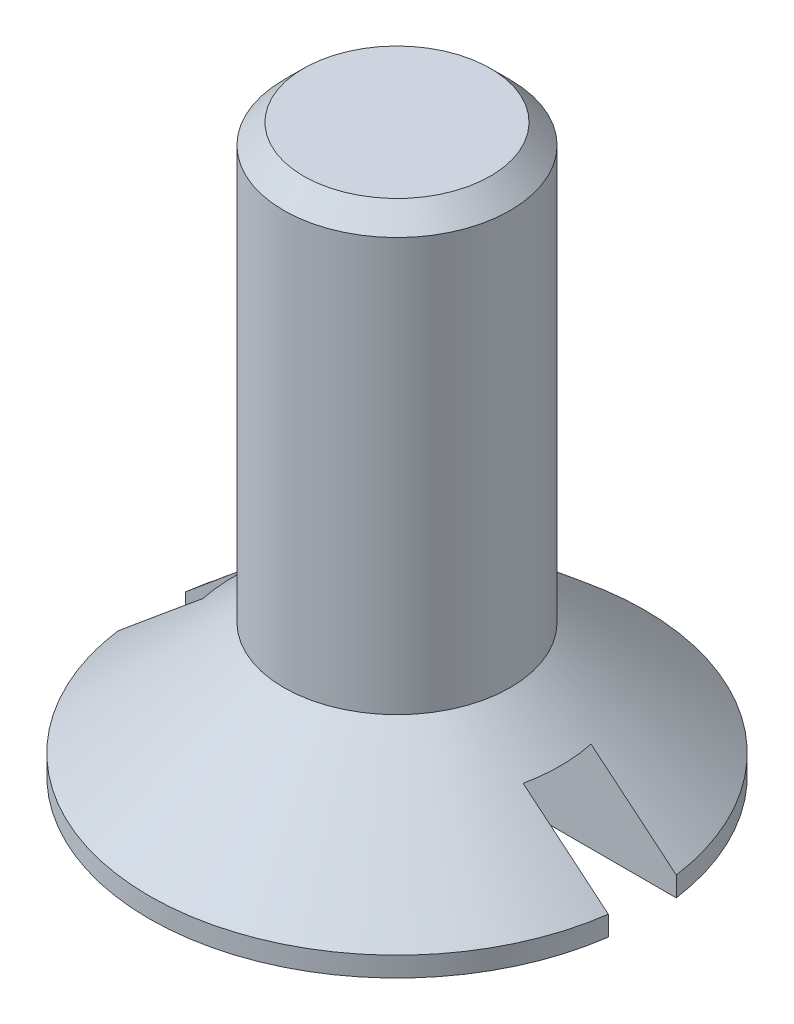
ISO-10303-21;
HEADER;
FILE_DESCRIPTION(('STEP AP214'),'2;1');
FILE_NAME('part.step','',(''),(''),'','','');
FILE_SCHEMA(('AUTOMOTIVE_DESIGN { 1 0 10303 214 1 1 1 1 }'));
ENDSEC;
DATA;
#1=APPLICATION_CONTEXT('core data for automotive mechanical design processes');
#2=APPLICATION_PROTOCOL_DEFINITION('international standard','automotive_design',2000,#1);
#3=PRODUCT_CONTEXT('',#1,'mechanical');
#4=PRODUCT('Part','Part','',(#3));
#5=PRODUCT_RELATED_PRODUCT_CATEGORY('part','',(#4));
#6=PRODUCT_DEFINITION_FORMATION('','',#4);
#7=PRODUCT_DEFINITION_CONTEXT('part definition',#1,'design');
#8=PRODUCT_DEFINITION('design','',#6,#7);
#9=PRODUCT_DEFINITION_SHAPE('','',#8);
#10=(LENGTH_UNIT() NAMED_UNIT(*) SI_UNIT(.MILLI.,.METRE.));
#11=(NAMED_UNIT(*) PLANE_ANGLE_UNIT() SI_UNIT($,.RADIAN.));
#12=(NAMED_UNIT(*) SI_UNIT($,.STERADIAN.) SOLID_ANGLE_UNIT());
#13=UNCERTAINTY_MEASURE_WITH_UNIT(LENGTH_MEASURE(1.E-05),#10,'distance_accuracy_value','');
#14=(GEOMETRIC_REPRESENTATION_CONTEXT(3) GLOBAL_UNCERTAINTY_ASSIGNED_CONTEXT((#13)) GLOBAL_UNIT_ASSIGNED_CONTEXT((#10,
#11,#12)) REPRESENTATION_CONTEXT('',''));
#15=CARTESIAN_POINT('',(0.,0.,0.));
#16=DIRECTION('',(0.,0.,1.));
#17=DIRECTION('',(1.,0.,0.));
#18=AXIS2_PLACEMENT_3D('',#15,#16,#17);
#19=CARTESIAN_POINT('',(0.,10.0000000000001,0.));
#20=DIRECTION('',(0.,-1.,0.));
#21=DIRECTION('',(0.,0.,-1.));
#22=AXIS2_PLACEMENT_3D('',#19,#20,#21);
#23=CYLINDRICAL_SURFACE('',#22,2.);
#24=CARTESIAN_POINT('',(0.,2.35000000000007,0.));
#25=DIRECTION('',(0.,1.,0.));
#26=DIRECTION('',(0.,0.,1.));
#27=AXIS2_PLACEMENT_3D('',#24,#25,#26);
#28=CIRCLE('',#27,2.);
#29=CARTESIAN_POINT('',(0.,2.35000000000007,2.));
#30=VERTEX_POINT('',#29);
#31=EDGE_CURVE('E157',#30,#30,#28,.T.);
#32=ORIENTED_EDGE('',*,*,#31,.T.);
#33=EDGE_LOOP('',(#32));
#34=FACE_BOUND('',#33,.T.);
#35=CARTESIAN_POINT('',(0.,9.65000000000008,0.));
#36=DIRECTION('',(0.,-1.,0.));
#37=DIRECTION('',(0.,0.,-1.));
#38=AXIS2_PLACEMENT_3D('',#35,#36,#37);
#39=CIRCLE('',#38,2.);
#40=CARTESIAN_POINT('',(0.,9.65000000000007,-2.00000000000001));
#41=VERTEX_POINT('',#40);
#42=EDGE_CURVE('E115',#41,#41,#39,.F.);
#43=ORIENTED_EDGE('',*,*,#42,.F.);
#44=EDGE_LOOP('',(#43));
#45=FACE_BOUND('',#44,.T.);
#46=ADVANCED_FACE('F40',(#34,#45),#23,.T.);
#47=CARTESIAN_POINT('',(0.,0.35,0.));
#48=DIRECTION('',(0.,-1.,0.));
#49=DIRECTION('',(0.,0.,-1.));
#50=AXIS2_PLACEMENT_3D('',#47,#48,#49);
#51=CYLINDRICAL_SURFACE('',#50,4.375);
#52=CARTESIAN_POINT('',(0.,0.35,0.));
#53=DIRECTION('',(0.,1.,0.));
#54=DIRECTION('',(0.,0.,1.));
#55=AXIS2_PLACEMENT_3D('',#52,#53,#54);
#56=CIRCLE('',#55,4.375);
#57=CARTESIAN_POINT('',(4.33366184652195,0.35,-0.6));
#58=VERTEX_POINT('',#57);
#59=CARTESIAN_POINT('',(-4.33366184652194,0.349999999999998,-0.6));
#60=VERTEX_POINT('',#59);
#61=EDGE_CURVE('E121',#58,#60,#56,.T.);
#62=ORIENTED_EDGE('',*,*,#61,.F.);
#63=DIRECTION('',(0.,-1.,0.));
#64=VECTOR('',#63,1.);
#65=CARTESIAN_POINT('',(4.33366184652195,0.35,-0.6));
#66=LINE('',#65,#64);
#67=CARTESIAN_POINT('',(4.33366184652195,0.,-0.6));
#68=VERTEX_POINT('',#67);
#69=EDGE_CURVE('E100',#58,#68,#66,.T.);
#70=ORIENTED_EDGE('',*,*,#69,.T.);
#71=CARTESIAN_POINT('',(0.,0.,0.));
#72=DIRECTION('',(0.,1.,0.));
#73=DIRECTION('',(0.,0.,1.));
#74=AXIS2_PLACEMENT_3D('',#71,#72,#73);
#75=CIRCLE('',#74,4.375);
#76=CARTESIAN_POINT('',(-4.33366184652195,0.,-0.6));
#77=VERTEX_POINT('',#76);
#78=EDGE_CURVE('E180',#68,#77,#75,.T.);
#79=ORIENTED_EDGE('',*,*,#78,.T.);
#80=DIRECTION('',(0.,-1.,0.));
#81=VECTOR('',#80,1.);
#82=CARTESIAN_POINT('',(-4.33366184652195,0.35,-0.6));
#83=LINE('',#82,#81);
#84=EDGE_CURVE('E166',#77,#60,#83,.F.);
#85=ORIENTED_EDGE('',*,*,#84,.T.);
#86=EDGE_LOOP('',(#62,#70,#79,#85));
#87=FACE_BOUND('',#86,.T.);
#88=ADVANCED_FACE('F147',(#87),#51,.T.);
#89=CARTESIAN_POINT('',(0.,0.,0.));
#90=DIRECTION('',(0.,1.,0.));
#91=DIRECTION('',(0.,0.,1.));
#92=AXIS2_PLACEMENT_3D('',#89,#90,#91);
#93=PLANE('',#92);
#94=CARTESIAN_POINT('',(-4.33366184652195,0.,0.6));
#95=VERTEX_POINT('',#94);
#96=CARTESIAN_POINT('',(4.33366184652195,0.,0.6));
#97=VERTEX_POINT('',#96);
#98=EDGE_CURVE('E131',#95,#97,#75,.T.);
#99=ORIENTED_EDGE('',*,*,#98,.F.);
#100=DIRECTION('',(1.,0.,0.));
#101=VECTOR('',#100,1.);
#102=CARTESIAN_POINT('',(0.,0.,0.6));
#103=LINE('',#102,#101);
#104=EDGE_CURVE('E176',#95,#97,#103,.T.);
#105=ORIENTED_EDGE('',*,*,#104,.T.);
#106=EDGE_LOOP('',(#99,#105));
#107=FACE_BOUND('',#106,.T.);
#108=ADVANCED_FACE('F152',(#107),#93,.F.);
#109=CARTESIAN_POINT('',(-4.33366184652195,0.35,0.6));
#110=VERTEX_POINT('',#109);
#111=CARTESIAN_POINT('',(4.33366184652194,0.349999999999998,0.6));
#112=VERTEX_POINT('',#111);
#113=EDGE_CURVE('E123',#110,#112,#56,.T.);
#114=ORIENTED_EDGE('',*,*,#113,.F.);
#115=DIRECTION('',(0.,-1.,0.));
#116=VECTOR('',#115,1.);
#117=CARTESIAN_POINT('',(-4.33366184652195,0.35,0.6));
#118=LINE('',#117,#116);
#119=EDGE_CURVE('E70',#110,#95,#118,.T.);
#120=ORIENTED_EDGE('',*,*,#119,.T.);
#121=ORIENTED_EDGE('',*,*,#98,.T.);
#122=DIRECTION('',(0.,-1.,0.));
#123=VECTOR('',#122,1.);
#124=CARTESIAN_POINT('',(4.33366184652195,0.35,0.6));
#125=LINE('',#124,#123);
#126=EDGE_CURVE('E173',#97,#112,#125,.F.);
#127=ORIENTED_EDGE('',*,*,#126,.T.);
#128=EDGE_LOOP('',(#114,#120,#121,#127));
#129=FACE_BOUND('',#128,.T.);
#130=ADVANCED_FACE('F42',(#129),#51,.T.);
#131=ORIENTED_EDGE('',*,*,#78,.F.);
#132=DIRECTION('',(-1.,0.,0.));
#133=VECTOR('',#132,1.);
#134=CARTESIAN_POINT('',(0.,0.,-0.6));
#135=LINE('',#134,#133);
#136=EDGE_CURVE('E169',#68,#77,#135,.T.);
#137=ORIENTED_EDGE('',*,*,#136,.T.);
#138=EDGE_LOOP('',(#131,#137));
#139=FACE_BOUND('',#138,.T.);
#140=ADVANCED_FACE('F189',(#139),#93,.F.);
#141=CARTESIAN_POINT('',(0.,2.35000000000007,0.));
#142=DIRECTION('',(0.,-1.,0.));
#143=DIRECTION('',(0.,0.,-1.));
#144=AXIS2_PLACEMENT_3D('',#141,#142,#143);
#145=CONICAL_SURFACE('',#144,2.,0.870903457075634);
#146=CARTESIAN_POINT('',(-9.67850085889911,-4.13175237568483,0.6));
#147=CARTESIAN_POINT('',(-9.31336552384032,-3.82486562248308,0.6));
#148=CARTESIAN_POINT('',(-8.9482034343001,-3.51801067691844,0.6));
#149=CARTESIAN_POINT('',(-8.21776497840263,-2.90439837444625,0.6));
#150=CARTESIAN_POINT('',(-7.85248860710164,-2.59764102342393,0.6));
#151=CARTESIAN_POINT('',(-7.12139139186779,-1.98394783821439,0.6));
#152=CARTESIAN_POINT('',(-6.75557039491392,-1.67701218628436,0.6));
#153=CARTESIAN_POINT('',(-6.02372580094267,-1.06342038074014,0.6));
#154=CARTESIAN_POINT('',(-5.65770221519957,-0.756764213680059,0.6));
#155=CARTESIAN_POINT('',(-4.95505890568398,-0.168825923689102,0.6));
#156=CARTESIAN_POINT('',(-4.61846877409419,0.112491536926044,0.6));
#157=CARTESIAN_POINT('',(-4.1131009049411,0.533941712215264,0.6));
#158=CARTESIAN_POINT('',(-3.94455153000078,0.674348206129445,0.6));
#159=CARTESIAN_POINT('',(-3.60723150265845,0.954889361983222,0.6));
#160=CARTESIAN_POINT('',(-3.43846085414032,1.09502402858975,0.6));
#161=CARTESIAN_POINT('',(-3.1006974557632,1.37478436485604,0.6));
#162=CARTESIAN_POINT('',(-2.93170494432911,1.51441032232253,0.6));
#163=CARTESIAN_POINT('',(-2.59316416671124,1.79301100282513,0.6));
#164=CARTESIAN_POINT('',(-2.42361586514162,1.93198568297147,0.6));
#165=CARTESIAN_POINT('',(-2.16857585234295,2.13951951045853,0.6));
#166=CARTESIAN_POINT('',(-2.08345447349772,2.20853348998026,0.6));
#167=CARTESIAN_POINT('',(-1.91286013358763,2.34612522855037,0.6));
#168=CARTESIAN_POINT('',(-1.82738717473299,2.41470299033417,0.6));
#169=CARTESIAN_POINT('',(-1.65593776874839,2.55120836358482,0.6));
#170=CARTESIAN_POINT('',(-1.56996137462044,2.61913604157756,0.6));
#171=CARTESIAN_POINT('',(-1.39722970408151,2.75399258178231,0.6));
#172=CARTESIAN_POINT('',(-1.31047446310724,2.82092148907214,0.6));
#173=CARTESIAN_POINT('',(-1.20297855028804,2.90218745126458,0.6));
#174=CARTESIAN_POINT('',(-1.18284973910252,2.9173336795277,0.6));
#175=CARTESIAN_POINT('',(-1.14251240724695,2.94751992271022,0.6));
#176=CARTESIAN_POINT('',(-1.12230388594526,2.96255993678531,0.6));
#177=CARTESIAN_POINT('',(-1.06154011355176,3.00750111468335,0.6));
#178=CARTESIAN_POINT('',(-1.02085013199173,3.0372207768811,0.6));
#179=CARTESIAN_POINT('',(-0.93854291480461,3.09633244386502,0.6));
#180=CARTESIAN_POINT('',(-0.896920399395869,3.1257171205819,0.6));
#181=CARTESIAN_POINT('',(-0.813035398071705,3.18354042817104,0.6));
#182=CARTESIAN_POINT('',(-0.77077307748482,3.21197929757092,0.6));
#183=CARTESIAN_POINT('',(-0.684852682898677,3.2678182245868,0.6));
#184=CARTESIAN_POINT('',(-0.641184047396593,3.29520216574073,0.6));
#185=CARTESIAN_POINT('',(-0.552500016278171,3.34787478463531,0.6));
#186=CARTESIAN_POINT('',(-0.507482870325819,3.37316056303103,0.6));
#187=CARTESIAN_POINT('',(-0.416184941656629,3.42004445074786,0.6));
#188=CARTESIAN_POINT('',(-0.36992481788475,3.44168185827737,0.6));
#189=CARTESIAN_POINT('',(-0.275251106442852,3.479418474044,0.6));
#190=CARTESIAN_POINT('',(-0.226845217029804,3.49553591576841,0.6));
#191=CARTESIAN_POINT('',(-0.136035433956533,3.51718796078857,0.6));
#192=CARTESIAN_POINT('',(-0.0939621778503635,3.52403157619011,0.6));
#193=CARTESIAN_POINT('',(-0.00935597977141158,3.53012461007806,0.6));
#194=CARTESIAN_POINT('',(0.0331752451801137,3.52939631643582,0.6));
#195=CARTESIAN_POINT('',(0.12702551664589,3.51956584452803,0.6));
#196=CARTESIAN_POINT('',(0.178140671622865,3.50859488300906,0.6));
#197=CARTESIAN_POINT('',(0.253068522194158,3.48620660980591,0.6));
#198=CARTESIAN_POINT('',(0.277855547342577,3.47770610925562,0.6));
#199=CARTESIAN_POINT('',(0.326837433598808,3.45913927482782,0.6));
#200=CARTESIAN_POINT('',(0.351032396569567,3.44907321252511,0.6));
#201=CARTESIAN_POINT('',(0.417496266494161,3.4194205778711,0.6));
#202=CARTESIAN_POINT('',(0.459172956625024,3.39852267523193,0.6));
#203=CARTESIAN_POINT('',(0.541217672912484,3.35427729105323,0.6));
#204=CARTESIAN_POINT('',(0.581584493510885,3.33092763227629,0.6));
#205=CARTESIAN_POINT('',(0.661433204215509,3.28255264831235,0.6));
#206=CARTESIAN_POINT('',(0.700912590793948,3.25752322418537,0.6));
#207=CARTESIAN_POINT('',(0.779143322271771,3.20634684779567,0.6));
#208=CARTESIAN_POINT('',(0.817894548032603,3.18019971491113,0.6));
#209=CARTESIAN_POINT('',(0.933694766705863,3.10034957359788,0.6));
#210=CARTESIAN_POINT('',(1.00992724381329,3.04546705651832,0.6));
#211=CARTESIAN_POINT('',(1.16099266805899,2.93410970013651,0.6));
#212=CARTESIAN_POINT('',(1.23582786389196,2.87763786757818,0.6));
#213=CARTESIAN_POINT('',(1.38364888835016,2.76445910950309,0.6));
#214=CARTESIAN_POINT('',(1.45664590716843,2.70776678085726,0.6));
#215=CARTESIAN_POINT('',(1.60212030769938,2.59372001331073,0.6));
#216=CARTESIAN_POINT('',(1.67459768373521,2.53636556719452,0.6));
#217=CARTESIAN_POINT('',(1.89150561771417,2.36362301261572,0.6));
#218=CARTESIAN_POINT('',(2.0354012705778,2.24756400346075,0.6));
#219=CARTESIAN_POINT('',(2.32254966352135,2.0144167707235,0.6));
#220=CARTESIAN_POINT('',(2.4658017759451,1.89732777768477,0.6));
#221=CARTESIAN_POINT('',(2.75183437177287,1.66258666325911,0.6));
#222=CARTESIAN_POINT('',(2.89461487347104,1.54493456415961,0.6));
#223=CARTESIAN_POINT('',(3.17904779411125,1.30995179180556,0.6));
#224=CARTESIAN_POINT('',(3.3207019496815,1.1926232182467,0.6));
#225=CARTESIAN_POINT('',(3.60380753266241,0.957718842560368,0.6));
#226=CARTESIAN_POINT('',(3.74525895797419,0.84014303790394,0.6));
#227=CARTESIAN_POINT('',(4.16931580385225,0.487226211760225,0.6));
#228=CARTESIAN_POINT('',(4.4517065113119,0.251627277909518,0.6));
#229=CARTESIAN_POINT('',(5.14521263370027,-0.327744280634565,0.6));
#230=CARTESIAN_POINT('',(5.55615275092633,-0.67172658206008,0.6));
#231=CARTESIAN_POINT('',(6.37774325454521,-1.36012741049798,0.6));
#232=CARTESIAN_POINT('',(6.78839360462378,-1.70454598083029,0.6));
#233=CARTESIAN_POINT('',(7.61238042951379,-2.39603073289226,0.6));
#234=CARTESIAN_POINT('',(8.02571554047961,-2.74309853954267,0.6));
#235=CARTESIAN_POINT('',(8.85221099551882,-3.43734948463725,0.6));
#236=CARTESIAN_POINT('',(9.26537135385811,-3.78453260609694,0.6));
#237=CARTESIAN_POINT('',(9.67850085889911,-4.13175237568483,0.6));
#238=B_SPLINE_CURVE_WITH_KNOTS('',3,(#146,#147,#148,#149,#150,#151,#152,#153,#154,#155,#156,
#157,#158,#159,#160,#161,#162,#163,#164,#165,#166,#167,#168,#169,#170,#171,#172,#173,#174,#175,
#176,#177,#178,#179,#180,#181,#182,#183,#184,#185,#186,#187,#188,#189,#190,#191,#192,#193,#194,
#195,#196,#197,#198,#199,#200,#201,#202,#203,#204,#205,#206,#207,#208,#209,#210,#211,#212,#213,
#214,#215,#216,#217,#218,#219,#220,#221,#222,#223,#224,#225,#226,#227,#228,#229,#230,#231,#232,
#233,#234,#235,#236,#237),.UNSPECIFIED.,.F.,.F.,(4,2,2,2,2,2,2,2,2,2,2,2,2,2,2,2,2,2,2,2,2,2,2,
2,2,2,2,2,2,2,2,2,2,2,2,2,2,2,2,2,2,2,2,2,2,4),(0.,1.43091917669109,2.86191254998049,
4.29450119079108,5.7270168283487,7.04302976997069,7.70113741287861,8.3592336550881,
9.01686886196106,9.67454678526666,10.0032969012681,10.3320449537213,10.6607589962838,
10.9894581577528,11.065030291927,11.1406030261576,11.2917615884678,11.4446024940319,
11.5974045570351,11.7520006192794,11.9068068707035,12.0598211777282,12.2123250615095,
12.3396182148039,12.4665367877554,12.6223517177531,12.7009321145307,12.7794988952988,
12.9192264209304,13.0590790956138,13.1992864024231,13.3395164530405,13.6212634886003,
13.9025092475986,14.179781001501,14.4570557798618,15.0116460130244,15.5666933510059,
16.1217188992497,16.6735220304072,17.2253308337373,18.3286262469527,19.936344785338,
21.5442379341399,23.1634098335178,24.7824027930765),.UNSPECIFIED.);
#239=CARTESIAN_POINT('',(2.82766916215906,1.6,0.6));
#240=VERTEX_POINT('',#239);
#241=EDGE_CURVE('E12',#240,#112,#238,.T.);
#242=ORIENTED_EDGE('',*,*,#241,.F.);
#243=CARTESIAN_POINT('',(0.,1.6,0.));
#244=DIRECTION('',(0.,1.,0.));
#245=DIRECTION('',(0.,0.,1.));
#246=AXIS2_PLACEMENT_3D('',#243,#244,#245);
#247=CIRCLE('',#246,2.89062500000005);
#248=CARTESIAN_POINT('',(2.82766916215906,1.6,-0.6));
#249=VERTEX_POINT('',#248);
#250=EDGE_CURVE('E55',#249,#240,#247,.F.);
#251=ORIENTED_EDGE('',*,*,#250,.F.);
#252=CARTESIAN_POINT('',(9.67850085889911,-4.13175237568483,-0.6));
#253=CARTESIAN_POINT('',(9.31336552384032,-3.82486562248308,-0.6));
#254=CARTESIAN_POINT('',(8.9482034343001,-3.51801067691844,-0.6));
#255=CARTESIAN_POINT('',(8.21776497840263,-2.90439837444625,-0.6));
#256=CARTESIAN_POINT('',(7.85248860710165,-2.59764102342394,-0.6));
#257=CARTESIAN_POINT('',(7.1213913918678,-1.98394783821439,-0.6));
#258=CARTESIAN_POINT('',(6.75557039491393,-1.67701218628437,-0.6));
#259=CARTESIAN_POINT('',(6.02372580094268,-1.06342038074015,-0.6));
#260=CARTESIAN_POINT('',(5.65770221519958,-0.756764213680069,-0.6));
#261=CARTESIAN_POINT('',(4.95505890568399,-0.168825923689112,-0.6));
#262=CARTESIAN_POINT('',(4.6184687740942,0.112491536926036,-0.6));
#263=CARTESIAN_POINT('',(4.1131009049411,0.533941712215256,-0.6));
#264=CARTESIAN_POINT('',(3.94455153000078,0.674348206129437,-0.6));
#265=CARTESIAN_POINT('',(3.60723150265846,0.954889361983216,-0.6));
#266=CARTESIAN_POINT('',(3.43846085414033,1.09502402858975,-0.6));
#267=CARTESIAN_POINT('',(3.10069745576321,1.37478436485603,-0.6));
#268=CARTESIAN_POINT('',(2.93170494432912,1.51441032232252,-0.6));
#269=CARTESIAN_POINT('',(2.59316416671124,1.79301100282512,-0.6));
#270=CARTESIAN_POINT('',(2.42361586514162,1.93198568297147,-0.6));
#271=CARTESIAN_POINT('',(2.16857585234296,2.13951951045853,-0.6));
#272=CARTESIAN_POINT('',(2.08345447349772,2.20853348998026,-0.6));
#273=CARTESIAN_POINT('',(1.91286013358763,2.34612522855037,-0.6));
#274=CARTESIAN_POINT('',(1.827387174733,2.41470299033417,-0.6));
#275=CARTESIAN_POINT('',(1.65593776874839,2.55120836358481,-0.6));
#276=CARTESIAN_POINT('',(1.56996137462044,2.61913604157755,-0.6));
#277=CARTESIAN_POINT('',(1.39722970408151,2.75399258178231,-0.6));
#278=CARTESIAN_POINT('',(1.31047446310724,2.82092148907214,-0.6));
#279=CARTESIAN_POINT('',(1.20297855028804,2.90218745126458,-0.6));
#280=CARTESIAN_POINT('',(1.18284973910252,2.9173336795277,-0.6));
#281=CARTESIAN_POINT('',(1.14251240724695,2.94751992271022,-0.6));
#282=CARTESIAN_POINT('',(1.12230388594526,2.96255993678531,-0.6));
#283=CARTESIAN_POINT('',(1.06154011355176,3.00750111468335,-0.6));
#284=CARTESIAN_POINT('',(1.02085013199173,3.0372207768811,-0.6));
#285=CARTESIAN_POINT('',(0.938542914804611,3.09633244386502,-0.6));
#286=CARTESIAN_POINT('',(0.89692039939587,3.1257171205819,-0.6));
#287=CARTESIAN_POINT('',(0.813035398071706,3.18354042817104,-0.6));
#288=CARTESIAN_POINT('',(0.770773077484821,3.21197929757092,-0.6));
#289=CARTESIAN_POINT('',(0.684852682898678,3.2678182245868,-0.6));
#290=CARTESIAN_POINT('',(0.641184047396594,3.29520216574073,-0.6));
#291=CARTESIAN_POINT('',(0.552500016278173,3.34787478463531,-0.6));
#292=CARTESIAN_POINT('',(0.50748287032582,3.37316056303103,-0.6));
#293=CARTESIAN_POINT('',(0.416184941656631,3.42004445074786,-0.6));
#294=CARTESIAN_POINT('',(0.369924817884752,3.44168185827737,-0.6));
#295=CARTESIAN_POINT('',(0.275251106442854,3.479418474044,-0.6));
#296=CARTESIAN_POINT('',(0.226845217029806,3.49553591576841,-0.6));
#297=CARTESIAN_POINT('',(0.136035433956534,3.51718796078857,-0.6));
#298=CARTESIAN_POINT('',(0.0939621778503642,3.52403157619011,-0.6));
#299=CARTESIAN_POINT('',(0.00935597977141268,3.53012461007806,-0.6));
#300=CARTESIAN_POINT('',(-0.0331752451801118,3.52939631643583,-0.6));
#301=CARTESIAN_POINT('',(-0.127025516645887,3.51956584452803,-0.6));
#302=CARTESIAN_POINT('',(-0.178140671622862,3.50859488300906,-0.6));
#303=CARTESIAN_POINT('',(-0.253068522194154,3.48620660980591,-0.6));
#304=CARTESIAN_POINT('',(-0.277855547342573,3.47770610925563,-0.6));
#305=CARTESIAN_POINT('',(-0.326837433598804,3.45913927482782,-0.6));
#306=CARTESIAN_POINT('',(-0.351032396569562,3.44907321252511,-0.6));
#307=CARTESIAN_POINT('',(-0.417496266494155,3.4194205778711,-0.6));
#308=CARTESIAN_POINT('',(-0.459172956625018,3.39852267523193,-0.6));
#309=CARTESIAN_POINT('',(-0.541217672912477,3.35427729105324,-0.6));
#310=CARTESIAN_POINT('',(-0.581584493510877,3.33092763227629,-0.6));
#311=CARTESIAN_POINT('',(-0.6614332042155,3.28255264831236,-0.6));
#312=CARTESIAN_POINT('',(-0.700912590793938,3.25752322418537,-0.6));
#313=CARTESIAN_POINT('',(-0.77914332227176,3.20634684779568,-0.6));
#314=CARTESIAN_POINT('',(-0.817894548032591,3.18019971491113,-0.6));
#315=CARTESIAN_POINT('',(-0.933694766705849,3.1003495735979,-0.6));
#316=CARTESIAN_POINT('',(-1.00992724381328,3.04546705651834,-0.6));
#317=CARTESIAN_POINT('',(-1.16099266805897,2.93410970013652,-0.6));
#318=CARTESIAN_POINT('',(-1.23582786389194,2.8776378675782,-0.6));
#319=CARTESIAN_POINT('',(-1.38364888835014,2.76445910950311,-0.6));
#320=CARTESIAN_POINT('',(-1.45664590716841,2.70776678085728,-0.6));
#321=CARTESIAN_POINT('',(-1.60212030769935,2.59372001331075,-0.6));
#322=CARTESIAN_POINT('',(-1.67459768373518,2.53636556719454,-0.6));
#323=CARTESIAN_POINT('',(-1.89150561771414,2.36362301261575,-0.6));
#324=CARTESIAN_POINT('',(-2.03540127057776,2.24756400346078,-0.6));
#325=CARTESIAN_POINT('',(-2.32254966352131,2.01441677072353,-0.6));
#326=CARTESIAN_POINT('',(-2.46580177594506,1.8973277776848,-0.6));
#327=CARTESIAN_POINT('',(-2.75183437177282,1.66258666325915,-0.6));
#328=CARTESIAN_POINT('',(-2.89461487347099,1.54493456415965,-0.6));
#329=CARTESIAN_POINT('',(-3.1790477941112,1.3099517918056,-0.6));
#330=CARTESIAN_POINT('',(-3.32070194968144,1.19262321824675,-0.6));
#331=CARTESIAN_POINT('',(-3.60380753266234,0.95771884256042,-0.6));
#332=CARTESIAN_POINT('',(-3.74525895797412,0.840143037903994,-0.6));
#333=CARTESIAN_POINT('',(-4.16931580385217,0.487226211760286,-0.6));
#334=CARTESIAN_POINT('',(-4.45170651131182,0.251627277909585,-0.6));
#335=CARTESIAN_POINT('',(-5.14521263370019,-0.3277442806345,-0.6));
#336=CARTESIAN_POINT('',(-5.55615275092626,-0.671726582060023,-0.6));
#337=CARTESIAN_POINT('',(-6.37774325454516,-1.36012741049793,-0.6));
#338=CARTESIAN_POINT('',(-6.78839360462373,-1.70454598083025,-0.6));
#339=CARTESIAN_POINT('',(-7.61238042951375,-2.39603073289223,-0.6));
#340=CARTESIAN_POINT('',(-8.02571554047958,-2.74309853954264,-0.6));
#341=CARTESIAN_POINT('',(-8.8522109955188,-3.43734948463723,-0.6));
#342=CARTESIAN_POINT('',(-9.26537135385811,-3.78453260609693,-0.6));
#343=CARTESIAN_POINT('',(-9.67850085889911,-4.13175237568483,-0.6));
#344=B_SPLINE_CURVE_WITH_KNOTS('',3,(#252,#253,#254,#255,#256,#257,#258,#259,#260,#261,#262,
#263,#264,#265,#266,#267,#268,#269,#270,#271,#272,#273,#274,#275,#276,#277,#278,#279,#280,#281,
#282,#283,#284,#285,#286,#287,#288,#289,#290,#291,#292,#293,#294,#295,#296,#297,#298,#299,#300,
#301,#302,#303,#304,#305,#306,#307,#308,#309,#310,#311,#312,#313,#314,#315,#316,#317,#318,#319,
#320,#321,#322,#323,#324,#325,#326,#327,#328,#329,#330,#331,#332,#333,#334,#335,#336,#337,#338,
#339,#340,#341,#342,#343),.UNSPECIFIED.,.F.,.F.,(4,2,2,2,2,2,2,2,2,2,2,2,2,2,2,2,2,2,2,2,2,2,2,
2,2,2,2,2,2,2,2,2,2,2,2,2,2,2,2,2,2,2,2,2,2,4),(0.,1.43091917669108,2.86191254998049,
4.29450119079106,5.72701682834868,7.04302976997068,7.7011374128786,8.3592336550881,
9.01686886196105,9.67454678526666,10.0032969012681,10.3320449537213,10.6607589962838,
10.9894581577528,11.065030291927,11.1406030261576,11.2917615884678,11.4446024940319,
11.5974045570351,11.7520006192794,11.9068068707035,12.0598211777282,12.2123250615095,
12.3396182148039,12.4665367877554,12.6223517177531,12.7009321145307,12.7794988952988,
12.9192264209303,13.0590790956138,13.1992864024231,13.3395164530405,13.6212634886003,
13.9025092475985,14.179781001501,14.4570557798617,15.0116460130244,15.5666933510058,
16.1217188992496,16.6735220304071,17.2253308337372,18.3286262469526,19.9363447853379,
21.5442379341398,23.1634098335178,24.7824027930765),.UNSPECIFIED.);
#345=EDGE_CURVE('E97',#58,#249,#344,.T.);
#346=ORIENTED_EDGE('',*,*,#345,.F.);
#347=ORIENTED_EDGE('',*,*,#61,.T.);
#348=CARTESIAN_POINT('',(-2.82766916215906,1.6,-0.6));
#349=VERTEX_POINT('',#348);
#350=EDGE_CURVE('E106',#349,#60,#344,.T.);
#351=ORIENTED_EDGE('',*,*,#350,.F.);
#352=CARTESIAN_POINT('',(-2.82766916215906,1.6,0.6));
#353=VERTEX_POINT('',#352);
#354=EDGE_CURVE('E112',#353,#349,#247,.F.);
#355=ORIENTED_EDGE('',*,*,#354,.F.);
#356=EDGE_CURVE('E44',#110,#353,#238,.T.);
#357=ORIENTED_EDGE('',*,*,#356,.F.);
#358=ORIENTED_EDGE('',*,*,#113,.T.);
#359=EDGE_LOOP('',(#242,#251,#346,#347,#351,#355,#357,#358));
#360=FACE_BOUND('',#359,.T.);
#361=ORIENTED_EDGE('',*,*,#31,.F.);
#362=EDGE_LOOP('',(#361));
#363=FACE_BOUND('',#362,.T.);
#364=ADVANCED_FACE('F118',(#360,#363),#145,.T.);
#365=CARTESIAN_POINT('',(-4.375,-1.6,0.6));
#366=DIRECTION('',(0.,0.,1.));
#367=DIRECTION('',(1.,0.,0.));
#368=AXIS2_PLACEMENT_3D('',#365,#366,#367);
#369=PLANE('',#368);
#370=ORIENTED_EDGE('',*,*,#356,.T.);
#371=DIRECTION('',(1.,0.,0.));
#372=VECTOR('',#371,1.);
#373=CARTESIAN_POINT('',(-4.375,1.6,0.6));
#374=LINE('',#373,#372);
#375=EDGE_CURVE('E114',#353,#240,#374,.T.);
#376=ORIENTED_EDGE('',*,*,#375,.T.);
#377=ORIENTED_EDGE('',*,*,#241,.T.);
#378=ORIENTED_EDGE('',*,*,#126,.F.);
#379=ORIENTED_EDGE('',*,*,#104,.F.);
#380=ORIENTED_EDGE('',*,*,#119,.F.);
#381=EDGE_LOOP('',(#370,#376,#377,#378,#379,#380));
#382=FACE_BOUND('',#381,.T.);
#383=ADVANCED_FACE('F139',(#382),#369,.F.);
#384=CARTESIAN_POINT('',(-4.375,1.6,-0.6));
#385=DIRECTION('',(0.,1.,0.));
#386=DIRECTION('',(0.,0.,1.));
#387=AXIS2_PLACEMENT_3D('',#384,#385,#386);
#388=PLANE('',#387);
#389=ORIENTED_EDGE('',*,*,#354,.T.);
#390=DIRECTION('',(1.,0.,0.));
#391=VECTOR('',#390,1.);
#392=CARTESIAN_POINT('',(-4.375,1.6,-0.6));
#393=LINE('',#392,#391);
#394=EDGE_CURVE('E62',#349,#249,#393,.T.);
#395=ORIENTED_EDGE('',*,*,#394,.T.);
#396=ORIENTED_EDGE('',*,*,#250,.T.);
#397=ORIENTED_EDGE('',*,*,#375,.F.);
#398=EDGE_LOOP('',(#389,#395,#396,#397));
#399=FACE_BOUND('',#398,.T.);
#400=ADVANCED_FACE('F108',(#399),#388,.F.);
#401=CARTESIAN_POINT('',(-4.375,-1.6,-0.6));
#402=DIRECTION('',(0.,0.,-1.));
#403=DIRECTION('',(-1.,0.,0.));
#404=AXIS2_PLACEMENT_3D('',#401,#402,#403);
#405=PLANE('',#404);
#406=ORIENTED_EDGE('',*,*,#345,.T.);
#407=ORIENTED_EDGE('',*,*,#394,.F.);
#408=ORIENTED_EDGE('',*,*,#350,.T.);
#409=ORIENTED_EDGE('',*,*,#84,.F.);
#410=ORIENTED_EDGE('',*,*,#136,.F.);
#411=ORIENTED_EDGE('',*,*,#69,.F.);
#412=EDGE_LOOP('',(#406,#407,#408,#409,#410,#411));
#413=FACE_BOUND('',#412,.T.);
#414=ADVANCED_FACE('F98',(#413),#405,.F.);
#415=CARTESIAN_POINT('',(0.,10.0000000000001,0.));
#416=DIRECTION('',(0.,-1.,0.));
#417=DIRECTION('',(0.,0.,1.));
#418=AXIS2_PLACEMENT_3D('',#415,#416,#417);
#419=CONICAL_SURFACE('',#418,1.65,0.78539816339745);
#420=CARTESIAN_POINT('',(0.,10.0000000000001,0.));
#421=DIRECTION('',(0.,1.,0.));
#422=DIRECTION('',(0.,0.,1.));
#423=AXIS2_PLACEMENT_3D('',#420,#421,#422);
#424=CIRCLE('',#423,1.65);
#425=CARTESIAN_POINT('',(0.,10.0000000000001,1.64999999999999));
#426=VERTEX_POINT('',#425);
#427=EDGE_CURVE('E161',#426,#426,#424,.T.);
#428=ORIENTED_EDGE('',*,*,#427,.F.);
#429=EDGE_LOOP('',(#428));
#430=FACE_BOUND('',#429,.T.);
#431=ORIENTED_EDGE('',*,*,#42,.T.);
#432=EDGE_LOOP('',(#431));
#433=FACE_BOUND('',#432,.T.);
#434=ADVANCED_FACE('F137',(#430,#433),#419,.T.);
#435=CARTESIAN_POINT('',(0.,10.0000000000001,0.));
#436=DIRECTION('',(0.,1.,0.));
#437=DIRECTION('',(0.,0.,1.));
#438=AXIS2_PLACEMENT_3D('',#435,#436,#437);
#439=PLANE('',#438);
#440=ORIENTED_EDGE('',*,*,#427,.T.);
#441=EDGE_LOOP('',(#440));
#442=FACE_BOUND('',#441,.T.);
#443=ADVANCED_FACE('F143',(#442),#439,.T.);
#444=CLOSED_SHELL('',(#46,#88,#108,#130,#140,#364,#383,#400,#414,#434,#443));
#445=MANIFOLD_SOLID_BREP('B2',#444);
#446=ADVANCED_BREP_SHAPE_REPRESENTATION('',(#18,#445),#14);
#447=SHAPE_DEFINITION_REPRESENTATION(#9,#446);
ENDSEC;
END-ISO-10303-21;
